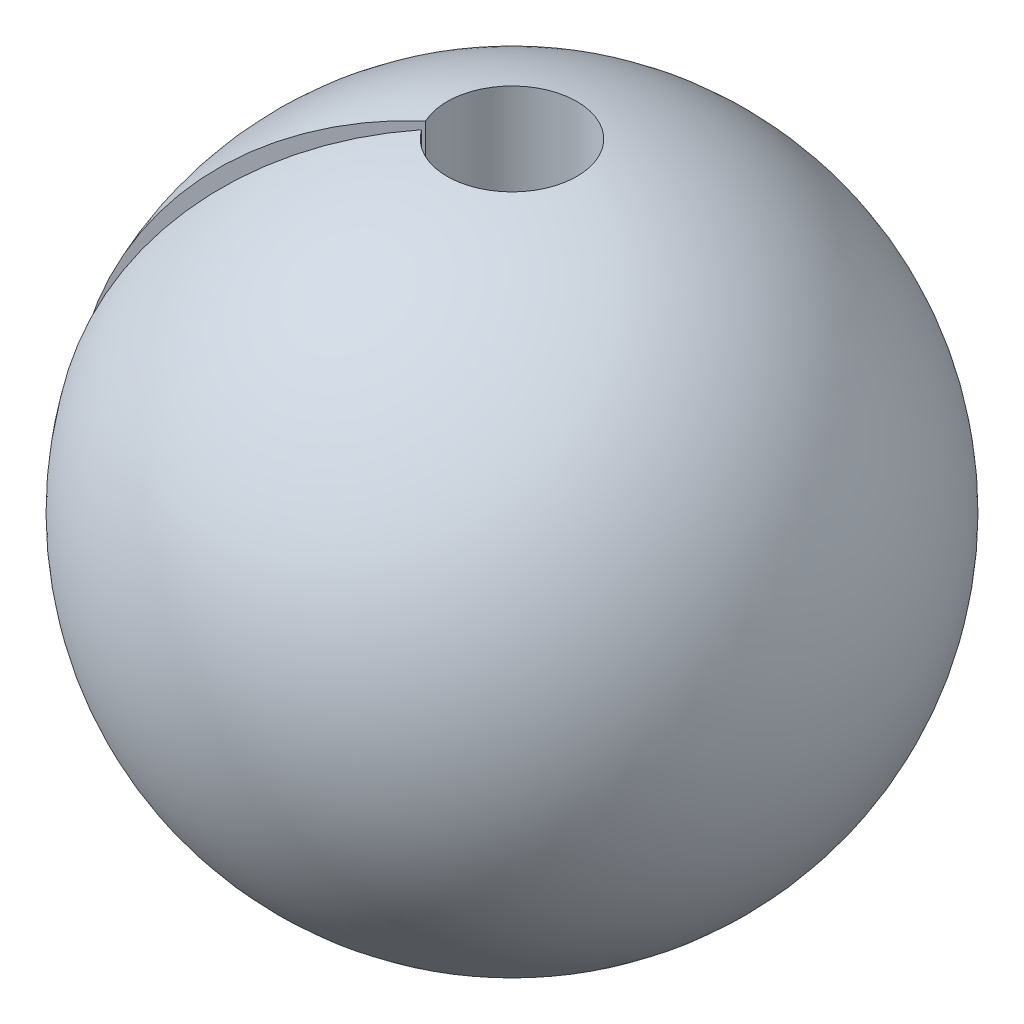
from build123d import *

# Parameters (mm, degrees)
CUT_EXTRUDE_1_DEPTH = 4425


with BuildPart() as part:
    # Sketch 1 → Revolve 1 (revolve)
    with BuildSketch(Plane.XY):
        with BuildLine():
            Line((-368, 2046.392912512), (-368, -1616.392912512))
            ThreePointArc((-368, -1616.392912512), (-1868, 215), (-368, 2046.392912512))
        make_face()
    revolve(axis=Axis((0, 0, 0), (0, 1, 0)))

    # Sketch 3 → Cut-Extrude 1 (cut, symmetric)
    with BuildSketch(Plane(origin=(0, 0, 0), x_dir=(1, 0, 0), z_dir=(0, 1, 0))):
        Polygon((-1974.323959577, -920.64238203), (0, 0), (-1833.547024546, -1283.863448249), align=None)
    extrude(amount=CUT_EXTRUDE_1_DEPTH, both=True, mode=Mode.SUBTRACT)


solid = part.part
